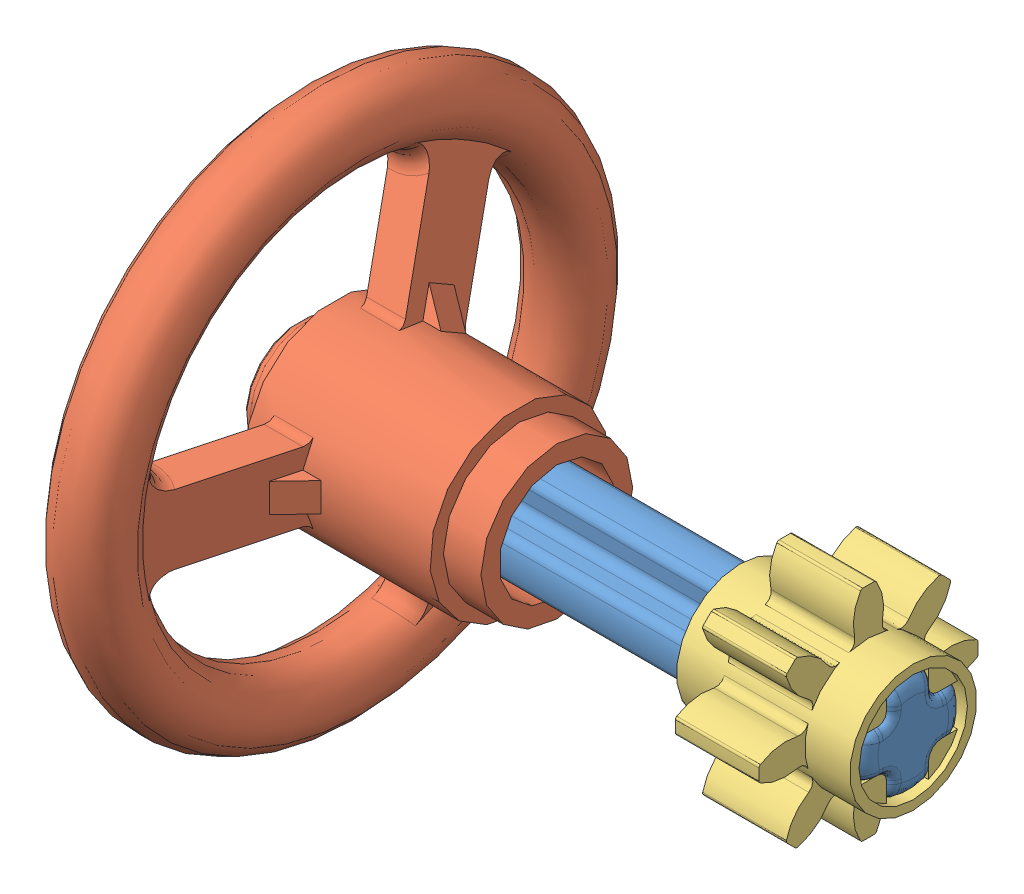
SolidWorks assembly steering asm.SLDASM, configuration Default (file format 4400). Lengths in mm.
Overall size (27.16 24 24).
3 component instances, 3 part files, 9 mates.
Components (placement in the parent):
- 3 axle-1: 3 axle.sldprt [Default] at origin size (23.91 4.72 4.72)
- steering wheel-1: steering wheel.SLDPRT [Default] at (-1.651 0 0) x (0 0 1) z (0 -1 0) size (24 11.43 24)
- Pinion-1: Pinion.SLDPRT [Default] at (20.0025 0 0) x (0 1 0) z (1 0 0) size (9.65 9.65 7.62)
Mates (geometry in assembly coordinates):
- Coincident1: coincident aligned: plane of 3 axle-1; plane of assembly
- Coincident2: coincident aligned: plane of 3 axle-1; plane of assembly
- Coincident3: coincident aligned: plane of 3 axle-1; plane of assembly
- Concentric1: concentric anti-aligned: cylinder of 3 axle-1 through (23.8125 0 0) axis (-1 0 0) radius 2.3622; cylinder of steering wheel-1 through (-8.8352 0 0) axis (1 0 0) radius 2.54
- Coincident4: coincident anti-aligned: plane of 3 axle-1 through (0 0 0) normal (-1 0 0); plane of steering wheel-1 through (0 0 0) normal (1 0 0)
- Concentric2: concentric anti-aligned: cylinder of 3 axle-1 through (23.8125 0 0) axis (-1 0 0) radius 2.3622; cylinder of Pinion-1 through (16.1925 0 0) axis (1 0 0) radius 2.3876
- Parallel3: parallel aligned: plane of 3 axle-1 through (-0.0464 0.9208 0.9208) normal (0 0 1); plane of steering wheel-1 through (-2.0456 0.9208 -0.9208) normal (0 0 1)
- Parallel4: parallel aligned: plane of 3 axle-1 through (-0.0464 0.9208 0.9208) normal (0 0 1); plane of Pinion-1 through (23.8125 0.9208 -0.9208) normal (0 0 1)
- Coincident6: coincident aligned: plane of 3 axle-1 through (23.8125 0 0) normal (1 0 0); plane of Pinion-1 through (23.8125 0 0) normal (1 0 0)
